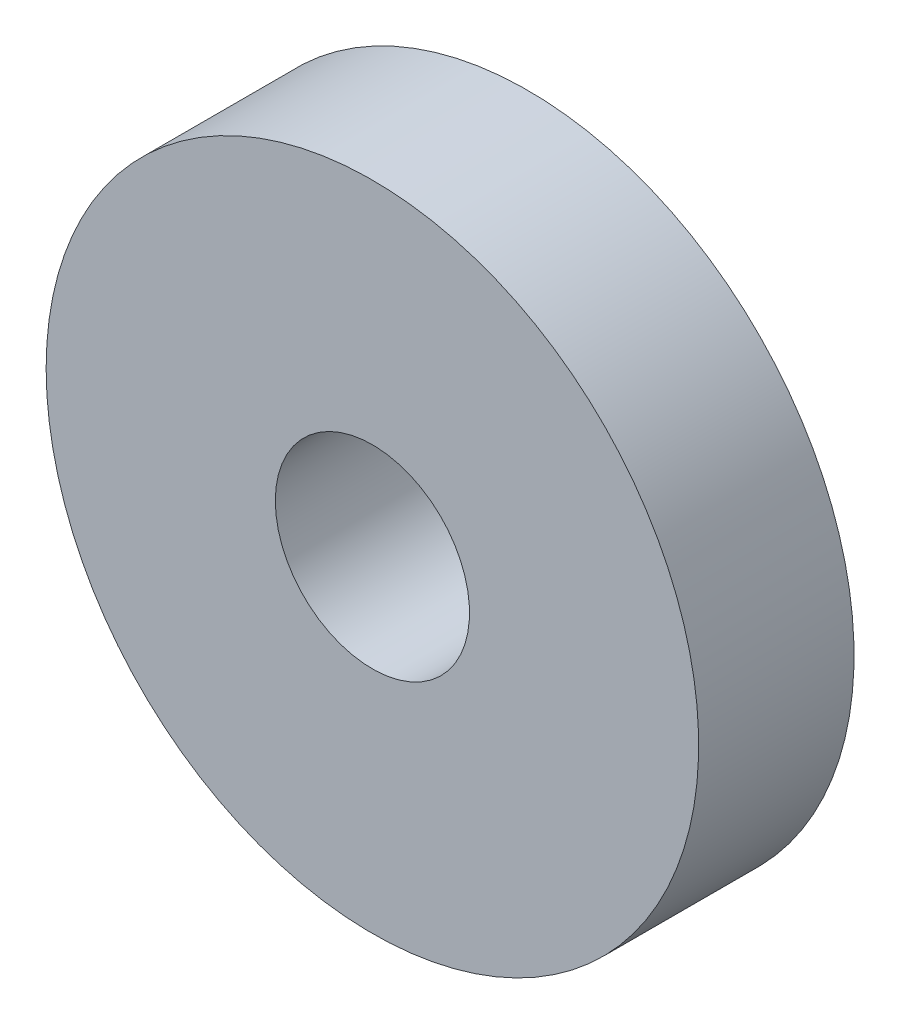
from build123d import *

# Parameters (mm, degrees)
BODYFV_W   = 21
BODYFV_H   = 10
THRUHLFV_W = 6.25
THRUHLFV_H = 10


with BuildPart() as part:
    # BodyFV → Revolve1 (revolve)
    with BuildSketch(Plane(origin=(0, 0, 0), x_dir=(1, 0, 0), z_dir=(0, 1, 0)), mode=Mode.PRIVATE) as revolve1_sk:
        with Locations((10.5, 5)):
            Rectangle(BODYFV_W, BODYFV_H)
    revolve(revolve1_sk.sketch.rotate(Axis((0, 0, 0), (0, 0, 1)), 180), axis=Axis((0, 0, 0), (0, 0, 1)))

    # ThruHlFV → Thru Hole (revolve, cut)
    with BuildSketch(Plane(origin=(0, 0, 0), x_dir=(1, 0, 0), z_dir=(0, 1, 0)), mode=Mode.PRIVATE) as thru_hole_sk:
        with Locations((3.125, 5)):
            Rectangle(THRUHLFV_W, THRUHLFV_H)
    revolve(thru_hole_sk.sketch.rotate(Axis((0, 0, 0), (0, 0, 1)), 180), axis=Axis((0, 0, 0), (0, 0, 1)), mode=Mode.SUBTRACT)


solid = part.part
